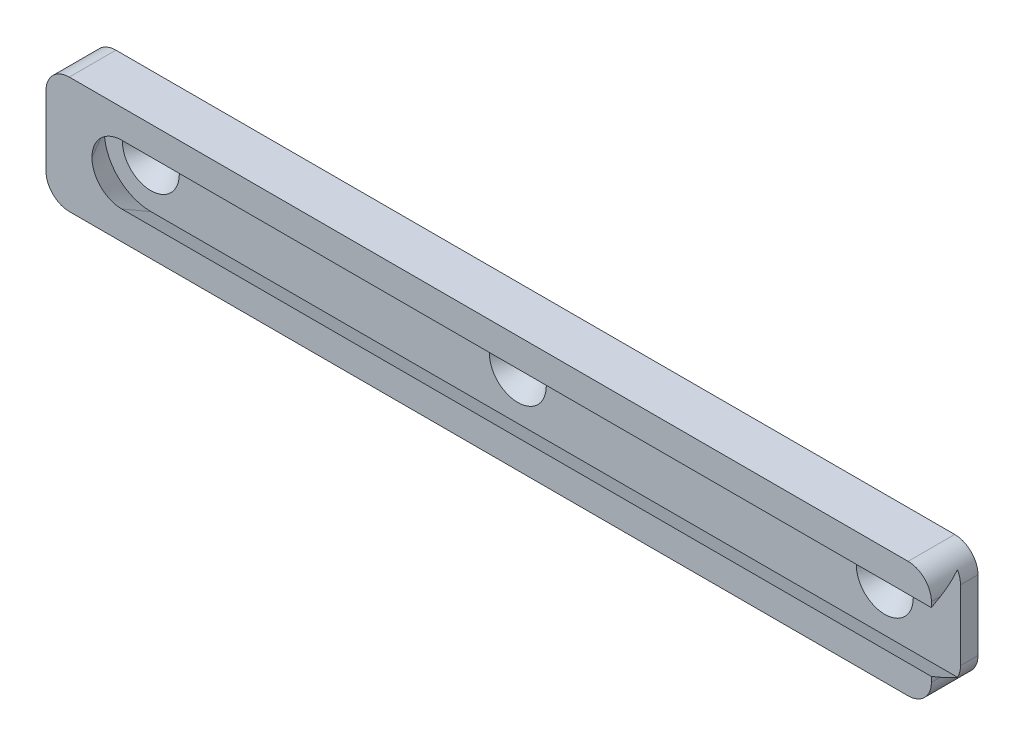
ISO-10303-21;
HEADER;
FILE_DESCRIPTION(('STEP AP214'),'2;1');
FILE_NAME('part.step','',(''),(''),'','','');
FILE_SCHEMA(('AUTOMOTIVE_DESIGN { 1 0 10303 214 1 1 1 1 }'));
ENDSEC;
DATA;
#1=APPLICATION_CONTEXT('core data for automotive mechanical design processes');
#2=APPLICATION_PROTOCOL_DEFINITION('international standard','automotive_design',2000,#1);
#3=PRODUCT_CONTEXT('',#1,'mechanical');
#4=PRODUCT('Part','Part','',(#3));
#5=PRODUCT_RELATED_PRODUCT_CATEGORY('part','',(#4));
#6=PRODUCT_DEFINITION_FORMATION('','',#4);
#7=PRODUCT_DEFINITION_CONTEXT('part definition',#1,'design');
#8=PRODUCT_DEFINITION('design','',#6,#7);
#9=PRODUCT_DEFINITION_SHAPE('','',#8);
#10=(LENGTH_UNIT() NAMED_UNIT(*) SI_UNIT(.MILLI.,.METRE.));
#11=(NAMED_UNIT(*) PLANE_ANGLE_UNIT() SI_UNIT($,.RADIAN.));
#12=(NAMED_UNIT(*) SI_UNIT($,.STERADIAN.) SOLID_ANGLE_UNIT());
#13=UNCERTAINTY_MEASURE_WITH_UNIT(LENGTH_MEASURE(1.E-05),#10,'distance_accuracy_value','');
#14=(GEOMETRIC_REPRESENTATION_CONTEXT(3) GLOBAL_UNCERTAINTY_ASSIGNED_CONTEXT((#13)) GLOBAL_UNIT_ASSIGNED_CONTEXT((#10,
#11,#12)) REPRESENTATION_CONTEXT('',''));
#15=CARTESIAN_POINT('',(0.,0.,0.));
#16=DIRECTION('',(0.,0.,1.));
#17=DIRECTION('',(1.,0.,0.));
#18=AXIS2_PLACEMENT_3D('',#15,#16,#17);
#19=CARTESIAN_POINT('',(0.,9.99999999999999,5.));
#20=DIRECTION('',(-1.,0.,0.));
#21=DIRECTION('',(0.,-1.,0.));
#22=AXIS2_PLACEMENT_3D('',#19,#20,#21);
#23=PLANE('',#22);
#24=DIRECTION('',(0.,1.,0.));
#25=VECTOR('',#24,1.);
#26=CARTESIAN_POINT('',(0.,9.99999999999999,5.));
#27=LINE('',#26,#25);
#28=CARTESIAN_POINT('',(0.,-5.99999999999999,5.));
#29=VERTEX_POINT('',#28);
#30=CARTESIAN_POINT('',(0.,-5.11324865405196,5.));
#31=VERTEX_POINT('',#30);
#32=EDGE_CURVE('E200',#29,#31,#27,.T.);
#33=ORIENTED_EDGE('',*,*,#32,.F.);
#34=DIRECTION('',(0.,0.,-1.));
#35=VECTOR('',#34,1.);
#36=CARTESIAN_POINT('',(0.,-5.99999999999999,5.));
#37=LINE('',#36,#35);
#38=CARTESIAN_POINT('',(0.,-5.99999999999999,3.4641016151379));
#39=VERTEX_POINT('',#38);
#40=EDGE_CURVE('E364',#29,#39,#37,.T.);
#41=ORIENTED_EDGE('',*,*,#40,.T.);
#42=DIRECTION('',(0.,-0.499999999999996,-0.866025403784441));
#43=VECTOR('',#42,1.);
#44=CARTESIAN_POINT('',(0.,-3.,8.66025403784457));
#45=LINE('',#44,#43);
#46=EDGE_CURVE('E180',#39,#31,#45,.F.);
#47=ORIENTED_EDGE('',*,*,#46,.T.);
#48=EDGE_LOOP('',(#33,#41,#47));
#49=FACE_BOUND('',#48,.T.);
#50=ADVANCED_FACE('F34',(#49),#23,.F.);
#51=DIRECTION('',(0.,1.,0.));
#52=VECTOR('',#51,1.);
#53=CARTESIAN_POINT('',(0.,-9.99999999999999,0.));
#54=LINE('',#53,#52);
#55=CARTESIAN_POINT('',(0.,-5.99999999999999,0.));
#56=VERTEX_POINT('',#55);
#57=CARTESIAN_POINT('',(0.,5.99999999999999,0.));
#58=VERTEX_POINT('',#57);
#59=EDGE_CURVE('E183',#56,#58,#54,.T.);
#60=ORIENTED_EDGE('',*,*,#59,.F.);
#61=DIRECTION('',(0.,0.,-1.));
#62=VECTOR('',#61,1.);
#63=CARTESIAN_POINT('',(0.,-5.99999999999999,5.));
#64=LINE('',#63,#62);
#65=CARTESIAN_POINT('',(0.,-5.99999999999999,-3.));
#66=VERTEX_POINT('',#65);
#67=EDGE_CURVE('E367',#56,#66,#64,.T.);
#68=ORIENTED_EDGE('',*,*,#67,.T.);
#69=DIRECTION('',(0.,1.,0.));
#70=VECTOR('',#69,1.);
#71=CARTESIAN_POINT('',(0.,-9.99999999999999,-3.));
#72=LINE('',#71,#70);
#73=CARTESIAN_POINT('',(0.,5.99999999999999,-3.));
#74=VERTEX_POINT('',#73);
#75=EDGE_CURVE('E187',#66,#74,#72,.T.);
#76=ORIENTED_EDGE('',*,*,#75,.T.);
#77=DIRECTION('',(0.,0.,-1.));
#78=VECTOR('',#77,1.);
#79=CARTESIAN_POINT('',(0.,5.99999999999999,5.));
#80=LINE('',#79,#78);
#81=EDGE_CURVE('E330',#74,#58,#80,.F.);
#82=ORIENTED_EDGE('',*,*,#81,.T.);
#83=EDGE_LOOP('',(#60,#68,#76,#82));
#84=FACE_BOUND('',#83,.T.);
#85=ADVANCED_FACE('F307',(#84),#23,.F.);
#86=CARTESIAN_POINT('',(-152.,9.99999999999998,5.));
#87=DIRECTION('',(1.,0.,0.));
#88=DIRECTION('',(0.,0.,-1.));
#89=AXIS2_PLACEMENT_3D('',#86,#87,#88);
#90=PLANE('',#89);
#91=DIRECTION('',(0.,-1.,0.));
#92=VECTOR('',#91,1.);
#93=CARTESIAN_POINT('',(-152.,-10.,-3.));
#94=LINE('',#93,#92);
#95=CARTESIAN_POINT('',(-152.,5.99999999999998,-3.));
#96=VERTEX_POINT('',#95);
#97=CARTESIAN_POINT('',(-152.,-6.00000000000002,-3.));
#98=VERTEX_POINT('',#97);
#99=EDGE_CURVE('E237',#96,#98,#94,.T.);
#100=ORIENTED_EDGE('',*,*,#99,.T.);
#101=DIRECTION('',(0.,0.,-1.));
#102=VECTOR('',#101,1.);
#103=CARTESIAN_POINT('',(-152.,-6.00000000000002,5.));
#104=LINE('',#103,#102);
#105=CARTESIAN_POINT('',(-152.,-6.00000000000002,5.));
#106=VERTEX_POINT('',#105);
#107=EDGE_CURVE('E11',#98,#106,#104,.F.);
#108=ORIENTED_EDGE('',*,*,#107,.T.);
#109=DIRECTION('',(0.,-1.,0.));
#110=VECTOR('',#109,1.);
#111=CARTESIAN_POINT('',(-152.,9.99999999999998,5.));
#112=LINE('',#111,#110);
#113=CARTESIAN_POINT('',(-152.,5.99999999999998,5.));
#114=VERTEX_POINT('',#113);
#115=EDGE_CURVE('E195',#114,#106,#112,.T.);
#116=ORIENTED_EDGE('',*,*,#115,.F.);
#117=DIRECTION('',(0.,0.,-1.));
#118=VECTOR('',#117,1.);
#119=CARTESIAN_POINT('',(-152.,5.99999999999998,5.));
#120=LINE('',#119,#118);
#121=EDGE_CURVE('E42',#114,#96,#120,.T.);
#122=ORIENTED_EDGE('',*,*,#121,.T.);
#123=EDGE_LOOP('',(#100,#108,#116,#122));
#124=FACE_BOUND('',#123,.T.);
#125=ADVANCED_FACE('F236',(#124),#90,.F.);
#126=CARTESIAN_POINT('',(-152.,-10.,5.));
#127=DIRECTION('',(0.,1.,0.));
#128=DIRECTION('',(-1.,0.,0.));
#129=AXIS2_PLACEMENT_3D('',#126,#127,#128);
#130=PLANE('',#129);
#131=DIRECTION('',(1.,0.,0.));
#132=VECTOR('',#131,1.);
#133=CARTESIAN_POINT('',(0.,-9.99999999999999,-3.));
#134=LINE('',#133,#132);
#135=CARTESIAN_POINT('',(-148.,-10.,-3.));
#136=VERTEX_POINT('',#135);
#137=CARTESIAN_POINT('',(-4.,-9.99999999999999,-3.));
#138=VERTEX_POINT('',#137);
#139=EDGE_CURVE('E193',#136,#138,#134,.T.);
#140=ORIENTED_EDGE('',*,*,#139,.T.);
#141=DIRECTION('',(0.,0.,-1.));
#142=VECTOR('',#141,1.);
#143=CARTESIAN_POINT('',(-4.,-9.99999999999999,5.));
#144=LINE('',#143,#142);
#145=CARTESIAN_POINT('',(-4.,-9.99999999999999,5.));
#146=VERTEX_POINT('',#145);
#147=EDGE_CURVE('E354',#138,#146,#144,.F.);
#148=ORIENTED_EDGE('',*,*,#147,.T.);
#149=DIRECTION('',(1.,0.,0.));
#150=VECTOR('',#149,1.);
#151=CARTESIAN_POINT('',(-152.,-10.,5.));
#152=LINE('',#151,#150);
#153=CARTESIAN_POINT('',(-148.,-10.,5.));
#154=VERTEX_POINT('',#153);
#155=EDGE_CURVE('E197',#154,#146,#152,.T.);
#156=ORIENTED_EDGE('',*,*,#155,.F.);
#157=DIRECTION('',(0.,0.,-1.));
#158=VECTOR('',#157,1.);
#159=CARTESIAN_POINT('',(-148.,-10.,5.));
#160=LINE('',#159,#158);
#161=EDGE_CURVE('E351',#154,#136,#160,.T.);
#162=ORIENTED_EDGE('',*,*,#161,.T.);
#163=EDGE_LOOP('',(#140,#148,#156,#162));
#164=FACE_BOUND('',#163,.T.);
#165=ADVANCED_FACE('F319',(#164),#130,.F.);
#166=DIRECTION('',(0.,-0.499999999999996,0.866025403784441));
#167=VECTOR('',#166,1.);
#168=CARTESIAN_POINT('',(0.,3.,8.66025403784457));
#169=LINE('',#168,#167);
#170=CARTESIAN_POINT('',(0.,5.11324865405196,5.));
#171=VERTEX_POINT('',#170);
#172=CARTESIAN_POINT('',(0.,5.99999999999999,3.4641016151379));
#173=VERTEX_POINT('',#172);
#174=EDGE_CURVE('E326',#171,#173,#169,.F.);
#175=ORIENTED_EDGE('',*,*,#174,.T.);
#176=DIRECTION('',(0.,0.,-1.));
#177=VECTOR('',#176,1.);
#178=CARTESIAN_POINT('',(0.,5.99999999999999,5.));
#179=LINE('',#178,#177);
#180=CARTESIAN_POINT('',(0.,5.99999999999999,5.));
#181=VERTEX_POINT('',#180);
#182=EDGE_CURVE('E219',#173,#181,#179,.F.);
#183=ORIENTED_EDGE('',*,*,#182,.T.);
#184=EDGE_CURVE('E199',#171,#181,#27,.T.);
#185=ORIENTED_EDGE('',*,*,#184,.F.);
#186=EDGE_LOOP('',(#175,#183,#185));
#187=FACE_BOUND('',#186,.T.);
#188=ADVANCED_FACE('F310',(#187),#23,.F.);
#189=CARTESIAN_POINT('',(-152.,9.99999999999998,5.));
#190=DIRECTION('',(0.,-1.,0.));
#191=DIRECTION('',(1.,0.,0.));
#192=AXIS2_PLACEMENT_3D('',#189,#190,#191);
#193=PLANE('',#192);
#194=DIRECTION('',(-1.,0.,0.));
#195=VECTOR('',#194,1.);
#196=CARTESIAN_POINT('',(-152.,9.99999999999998,5.));
#197=LINE('',#196,#195);
#198=CARTESIAN_POINT('',(-4.,9.99999999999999,5.));
#199=VERTEX_POINT('',#198);
#200=CARTESIAN_POINT('',(-148.,9.99999999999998,5.));
#201=VERTEX_POINT('',#200);
#202=EDGE_CURVE('E168',#199,#201,#197,.T.);
#203=ORIENTED_EDGE('',*,*,#202,.F.);
#204=DIRECTION('',(0.,0.,-1.));
#205=VECTOR('',#204,1.);
#206=CARTESIAN_POINT('',(-4.,9.99999999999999,5.));
#207=LINE('',#206,#205);
#208=CARTESIAN_POINT('',(-4.,9.99999999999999,-3.));
#209=VERTEX_POINT('',#208);
#210=EDGE_CURVE('E221',#199,#209,#207,.T.);
#211=ORIENTED_EDGE('',*,*,#210,.T.);
#212=DIRECTION('',(-1.,0.,0.));
#213=VECTOR('',#212,1.);
#214=CARTESIAN_POINT('',(0.,9.99999999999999,-3.));
#215=LINE('',#214,#213);
#216=CARTESIAN_POINT('',(-148.,9.99999999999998,-3.));
#217=VERTEX_POINT('',#216);
#218=EDGE_CURVE('E247',#209,#217,#215,.T.);
#219=ORIENTED_EDGE('',*,*,#218,.T.);
#220=DIRECTION('',(0.,0.,-1.));
#221=VECTOR('',#220,1.);
#222=CARTESIAN_POINT('',(-148.,9.99999999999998,5.));
#223=LINE('',#222,#221);
#224=EDGE_CURVE('E225',#217,#201,#223,.F.);
#225=ORIENTED_EDGE('',*,*,#224,.T.);
#226=EDGE_LOOP('',(#203,#211,#219,#225));
#227=FACE_BOUND('',#226,.T.);
#228=ADVANCED_FACE('F318',(#227),#193,.F.);
#229=CARTESIAN_POINT('',(0.,0.,5.));
#230=DIRECTION('',(0.,0.,1.));
#231=DIRECTION('',(1.,0.,0.));
#232=AXIS2_PLACEMENT_3D('',#229,#230,#231);
#233=PLANE('',#232);
#234=ORIENTED_EDGE('',*,*,#155,.T.);
#235=CARTESIAN_POINT('',(-4.,-5.99999999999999,5.));
#236=DIRECTION('',(0.,0.,1.));
#237=DIRECTION('',(1.,0.,0.));
#238=AXIS2_PLACEMENT_3D('',#235,#236,#237);
#239=CIRCLE('',#238,4.);
#240=EDGE_CURVE('E222',#146,#29,#239,.T.);
#241=ORIENTED_EDGE('',*,*,#240,.T.);
#242=ORIENTED_EDGE('',*,*,#32,.T.);
#243=DIRECTION('',(1.,0.,0.));
#244=VECTOR('',#243,1.);
#245=CARTESIAN_POINT('',(0.,-5.11324865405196,5.));
#246=LINE('',#245,#244);
#247=CARTESIAN_POINT('',(-139.,-5.11324865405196,5.));
#248=VERTEX_POINT('',#247);
#249=EDGE_CURVE('E328',#31,#248,#246,.F.);
#250=ORIENTED_EDGE('',*,*,#249,.T.);
#251=CARTESIAN_POINT('',(-139.,0.,5.));
#252=DIRECTION('',(0.,0.,1.));
#253=DIRECTION('',(1.,0.,0.));
#254=AXIS2_PLACEMENT_3D('',#251,#252,#253);
#255=CIRCLE('',#254,5.11324865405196);
#256=CARTESIAN_POINT('',(-144.113248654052,0.,5.));
#257=VERTEX_POINT('',#256);
#258=EDGE_CURVE('E331',#248,#257,#255,.F.);
#259=ORIENTED_EDGE('',*,*,#258,.T.);
#260=CARTESIAN_POINT('',(-139.,0.,5.));
#261=DIRECTION('',(0.,0.,1.));
#262=DIRECTION('',(1.,0.,0.));
#263=AXIS2_PLACEMENT_3D('',#260,#261,#262);
#264=CIRCLE('',#263,5.11324865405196);
#265=CARTESIAN_POINT('',(-139.,5.11324865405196,5.));
#266=VERTEX_POINT('',#265);
#267=EDGE_CURVE('E160',#257,#266,#264,.F.);
#268=ORIENTED_EDGE('',*,*,#267,.T.);
#269=DIRECTION('',(-1.,0.,0.));
#270=VECTOR('',#269,1.);
#271=CARTESIAN_POINT('',(0.,5.11324865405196,5.));
#272=LINE('',#271,#270);
#273=EDGE_CURVE('E175',#266,#171,#272,.F.);
#274=ORIENTED_EDGE('',*,*,#273,.T.);
#275=ORIENTED_EDGE('',*,*,#184,.T.);
#276=CARTESIAN_POINT('',(-4.,5.99999999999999,5.));
#277=DIRECTION('',(0.,0.,1.));
#278=DIRECTION('',(1.,0.,0.));
#279=AXIS2_PLACEMENT_3D('',#276,#277,#278);
#280=CIRCLE('',#279,4.);
#281=EDGE_CURVE('E207',#181,#199,#280,.T.);
#282=ORIENTED_EDGE('',*,*,#281,.T.);
#283=ORIENTED_EDGE('',*,*,#202,.T.);
#284=CARTESIAN_POINT('',(-148.,5.99999999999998,5.));
#285=DIRECTION('',(0.,0.,1.));
#286=DIRECTION('',(1.,0.,0.));
#287=AXIS2_PLACEMENT_3D('',#284,#285,#286);
#288=CIRCLE('',#287,4.);
#289=EDGE_CURVE('E54',#201,#114,#288,.T.);
#290=ORIENTED_EDGE('',*,*,#289,.T.);
#291=ORIENTED_EDGE('',*,*,#115,.T.);
#292=CARTESIAN_POINT('',(-148.,-6.00000000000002,5.));
#293=DIRECTION('',(0.,0.,1.));
#294=DIRECTION('',(1.,0.,0.));
#295=AXIS2_PLACEMENT_3D('',#292,#293,#294);
#296=CIRCLE('',#295,4.);
#297=EDGE_CURVE('E223',#106,#154,#296,.T.);
#298=ORIENTED_EDGE('',*,*,#297,.T.);
#299=EDGE_LOOP('',(#234,#241,#242,#250,#259,#268,#274,#275,#282,#283,#290,#291,#298));
#300=FACE_BOUND('',#299,.T.);
#301=ADVANCED_FACE('F206',(#300),#233,.T.);
#302=CARTESIAN_POINT('',(0.,3.,8.66025403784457));
#303=DIRECTION('',(0.,0.866025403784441,0.499999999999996));
#304=DIRECTION('',(1.,0.,0.));
#305=AXIS2_PLACEMENT_3D('',#302,#303,#304);
#306=PLANE('',#305);
#307=DIRECTION('',(-1.,0.,0.));
#308=VECTOR('',#307,1.);
#309=CARTESIAN_POINT('',(0.,8.00000000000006,0.));
#310=LINE('',#309,#308);
#311=CARTESIAN_POINT('',(-0.535898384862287,8.00000000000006,0.));
#312=VERTEX_POINT('',#311);
#313=CARTESIAN_POINT('',(-139.,8.00000000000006,0.));
#314=VERTEX_POINT('',#313);
#315=EDGE_CURVE('E165',#312,#314,#310,.T.);
#316=ORIENTED_EDGE('',*,*,#315,.F.);
#317=CARTESIAN_POINT('',(-4.,5.99999999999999,3.46410161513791));
#318=DIRECTION('',(0.,0.866025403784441,0.499999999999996));
#319=DIRECTION('',(0.,0.499999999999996,-0.866025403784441));
#320=AXIS2_PLACEMENT_3D('',#317,#318,#319);
#321=ELLIPSE('',#320,8.00000000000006,4.);
#322=EDGE_CURVE('E232',#312,#173,#321,.F.);
#323=ORIENTED_EDGE('',*,*,#322,.T.);
#324=ORIENTED_EDGE('',*,*,#174,.F.);
#325=ORIENTED_EDGE('',*,*,#273,.F.);
#326=DIRECTION('',(0.,-0.499999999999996,0.866025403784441));
#327=VECTOR('',#326,1.);
#328=CARTESIAN_POINT('',(-139.,8.00000000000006,0.));
#329=LINE('',#328,#327);
#330=EDGE_CURVE('E161',#314,#266,#329,.T.);
#331=ORIENTED_EDGE('',*,*,#330,.F.);
#332=EDGE_LOOP('',(#316,#323,#324,#325,#331));
#333=FACE_BOUND('',#332,.T.);
#334=ADVANCED_FACE('F373',(#333),#306,.F.);
#335=CARTESIAN_POINT('',(-139.,0.,0.));
#336=DIRECTION('',(0.,0.,-1.));
#337=DIRECTION('',(-1.,0.,0.));
#338=AXIS2_PLACEMENT_3D('',#335,#336,#337);
#339=CONICAL_SURFACE('',#338,8.00000000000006,0.523598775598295);
#340=ORIENTED_EDGE('',*,*,#330,.T.);
#341=ORIENTED_EDGE('',*,*,#267,.F.);
#342=DIRECTION('',(0.499999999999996,0.,0.866025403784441));
#343=VECTOR('',#342,1.);
#344=CARTESIAN_POINT('',(-147.,0.,0.));
#345=LINE('',#344,#343);
#346=CARTESIAN_POINT('',(-147.,0.,0.));
#347=VERTEX_POINT('',#346);
#348=EDGE_CURVE('E146',#347,#257,#345,.T.);
#349=ORIENTED_EDGE('',*,*,#348,.F.);
#350=CARTESIAN_POINT('',(-139.,0.,0.));
#351=DIRECTION('',(0.,0.,1.));
#352=DIRECTION('',(1.,0.,0.));
#353=AXIS2_PLACEMENT_3D('',#350,#351,#352);
#354=CIRCLE('',#353,8.00000000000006);
#355=EDGE_CURVE('E153',#314,#347,#354,.T.);
#356=ORIENTED_EDGE('',*,*,#355,.F.);
#357=EDGE_LOOP('',(#340,#341,#349,#356));
#358=FACE_BOUND('',#357,.T.);
#359=ADVANCED_FACE('F159',(#358),#339,.F.);
#360=CARTESIAN_POINT('',(-139.,0.,0.));
#361=DIRECTION('',(0.,0.,-1.));
#362=DIRECTION('',(-1.,0.,0.));
#363=AXIS2_PLACEMENT_3D('',#360,#361,#362);
#364=CONICAL_SURFACE('',#363,8.00000000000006,0.523598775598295);
#365=ORIENTED_EDGE('',*,*,#348,.T.);
#366=ORIENTED_EDGE('',*,*,#258,.F.);
#367=DIRECTION('',(0.,0.499999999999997,0.866025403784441));
#368=VECTOR('',#367,1.);
#369=CARTESIAN_POINT('',(-139.,-8.00000000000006,0.));
#370=LINE('',#369,#368);
#371=CARTESIAN_POINT('',(-139.,-8.00000000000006,0.));
#372=VERTEX_POINT('',#371);
#373=EDGE_CURVE('E148',#372,#248,#370,.T.);
#374=ORIENTED_EDGE('',*,*,#373,.F.);
#375=CARTESIAN_POINT('',(-139.,0.,0.));
#376=DIRECTION('',(0.,0.,1.));
#377=DIRECTION('',(1.,0.,0.));
#378=AXIS2_PLACEMENT_3D('',#375,#376,#377);
#379=CIRCLE('',#378,8.00000000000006);
#380=EDGE_CURVE('E142',#347,#372,#379,.T.);
#381=ORIENTED_EDGE('',*,*,#380,.F.);
#382=EDGE_LOOP('',(#365,#366,#374,#381));
#383=FACE_BOUND('',#382,.T.);
#384=ADVANCED_FACE('F144',(#383),#364,.F.);
#385=CARTESIAN_POINT('',(0.,-3.,8.66025403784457));
#386=DIRECTION('',(0.,-0.866025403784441,0.499999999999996));
#387=DIRECTION('',(-1.,0.,0.));
#388=AXIS2_PLACEMENT_3D('',#385,#386,#387);
#389=PLANE('',#388);
#390=ORIENTED_EDGE('',*,*,#46,.F.);
#391=CARTESIAN_POINT('',(-4.,-5.99999999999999,3.46410161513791));
#392=DIRECTION('',(0.,-0.866025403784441,0.499999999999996));
#393=DIRECTION('',(0.,-0.499999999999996,-0.866025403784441));
#394=AXIS2_PLACEMENT_3D('',#391,#392,#393);
#395=ELLIPSE('',#394,8.00000000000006,4.);
#396=CARTESIAN_POINT('',(-0.535898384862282,-8.00000000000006,0.));
#397=VERTEX_POINT('',#396);
#398=EDGE_CURVE('E339',#39,#397,#395,.F.);
#399=ORIENTED_EDGE('',*,*,#398,.T.);
#400=DIRECTION('',(1.,0.,0.));
#401=VECTOR('',#400,1.);
#402=CARTESIAN_POINT('',(0.,-8.00000000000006,0.));
#403=LINE('',#402,#401);
#404=EDGE_CURVE('E152',#372,#397,#403,.T.);
#405=ORIENTED_EDGE('',*,*,#404,.F.);
#406=ORIENTED_EDGE('',*,*,#373,.T.);
#407=ORIENTED_EDGE('',*,*,#249,.F.);
#408=EDGE_LOOP('',(#390,#399,#405,#406,#407));
#409=FACE_BOUND('',#408,.T.);
#410=ADVANCED_FACE('F376',(#409),#389,.F.);
#411=CARTESIAN_POINT('',(0.,0.,-3.));
#412=DIRECTION('',(0.,0.,1.));
#413=DIRECTION('',(1.,0.,0.));
#414=AXIS2_PLACEMENT_3D('',#411,#412,#413);
#415=PLANE('',#414);
#416=CARTESIAN_POINT('',(-139.,0.,-3.));
#417=DIRECTION('',(0.,0.,1.));
#418=DIRECTION('',(1.,0.,0.));
#419=AXIS2_PLACEMENT_3D('',#416,#417,#418);
#420=CIRCLE('',#419,2.55269999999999);
#421=CARTESIAN_POINT('',(-136.4473,0.,-3.));
#422=VERTEX_POINT('',#421);
#423=EDGE_CURVE('E270',#422,#422,#420,.T.);
#424=ORIENTED_EDGE('',*,*,#423,.T.);
#425=EDGE_LOOP('',(#424));
#426=FACE_BOUND('',#425,.T.);
#427=CARTESIAN_POINT('',(-75.9999999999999,0.,-3.));
#428=DIRECTION('',(0.,0.,1.));
#429=DIRECTION('',(1.,0.,0.));
#430=AXIS2_PLACEMENT_3D('',#427,#428,#429);
#431=CIRCLE('',#430,2.55270000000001);
#432=CARTESIAN_POINT('',(-73.4472999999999,0.,-3.));
#433=VERTEX_POINT('',#432);
#434=EDGE_CURVE('E261',#433,#433,#431,.T.);
#435=ORIENTED_EDGE('',*,*,#434,.T.);
#436=EDGE_LOOP('',(#435));
#437=FACE_BOUND('',#436,.T.);
#438=CARTESIAN_POINT('',(-12.9999999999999,0.,-3.));
#439=DIRECTION('',(0.,0.,1.));
#440=DIRECTION('',(1.,0.,0.));
#441=AXIS2_PLACEMENT_3D('',#438,#439,#440);
#442=CIRCLE('',#441,2.5527);
#443=CARTESIAN_POINT('',(-10.4472999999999,0.,-3.));
#444=VERTEX_POINT('',#443);
#445=EDGE_CURVE('E188',#444,#444,#442,.T.);
#446=ORIENTED_EDGE('',*,*,#445,.T.);
#447=EDGE_LOOP('',(#446));
#448=FACE_BOUND('',#447,.T.);
#449=ORIENTED_EDGE('',*,*,#75,.F.);
#450=CARTESIAN_POINT('',(-4.,-5.99999999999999,-3.));
#451=DIRECTION('',(0.,0.,1.));
#452=DIRECTION('',(1.,0.,0.));
#453=AXIS2_PLACEMENT_3D('',#450,#451,#452);
#454=CIRCLE('',#453,4.);
#455=EDGE_CURVE('E349',#66,#138,#454,.F.);
#456=ORIENTED_EDGE('',*,*,#455,.T.);
#457=ORIENTED_EDGE('',*,*,#139,.F.);
#458=CARTESIAN_POINT('',(-148.,-6.00000000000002,-3.));
#459=DIRECTION('',(0.,0.,1.));
#460=DIRECTION('',(1.,0.,0.));
#461=AXIS2_PLACEMENT_3D('',#458,#459,#460);
#462=CIRCLE('',#461,4.);
#463=EDGE_CURVE('E246',#136,#98,#462,.F.);
#464=ORIENTED_EDGE('',*,*,#463,.T.);
#465=ORIENTED_EDGE('',*,*,#99,.F.);
#466=CARTESIAN_POINT('',(-148.,5.99999999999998,-3.));
#467=DIRECTION('',(0.,0.,1.));
#468=DIRECTION('',(1.,0.,0.));
#469=AXIS2_PLACEMENT_3D('',#466,#467,#468);
#470=CIRCLE('',#469,4.);
#471=EDGE_CURVE('E243',#96,#217,#470,.F.);
#472=ORIENTED_EDGE('',*,*,#471,.T.);
#473=ORIENTED_EDGE('',*,*,#218,.F.);
#474=CARTESIAN_POINT('',(-4.,5.99999999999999,-3.));
#475=DIRECTION('',(0.,0.,1.));
#476=DIRECTION('',(1.,0.,0.));
#477=AXIS2_PLACEMENT_3D('',#474,#475,#476);
#478=CIRCLE('',#477,4.);
#479=EDGE_CURVE('E347',#209,#74,#478,.F.);
#480=ORIENTED_EDGE('',*,*,#479,.T.);
#481=EDGE_LOOP('',(#449,#456,#457,#464,#465,#472,#473,#480));
#482=FACE_BOUND('',#481,.T.);
#483=ADVANCED_FACE('F241',(#426,#437,#448,#482),#415,.F.);
#484=CARTESIAN_POINT('',(0.,0.,0.));
#485=DIRECTION('',(0.,0.,1.));
#486=DIRECTION('',(1.,0.,0.));
#487=AXIS2_PLACEMENT_3D('',#484,#485,#486);
#488=PLANE('',#487);
#489=CARTESIAN_POINT('',(-139.,0.,0.));
#490=DIRECTION('',(0.,0.,1.));
#491=DIRECTION('',(1.,0.,0.));
#492=AXIS2_PLACEMENT_3D('',#489,#490,#491);
#493=CIRCLE('',#492,4.88949999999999);
#494=CARTESIAN_POINT('',(-134.1105,0.,0.));
#495=VERTEX_POINT('',#494);
#496=EDGE_CURVE('E276',#495,#495,#493,.T.);
#497=ORIENTED_EDGE('',*,*,#496,.F.);
#498=EDGE_LOOP('',(#497));
#499=FACE_BOUND('',#498,.T.);
#500=CARTESIAN_POINT('',(-75.9999999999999,0.,0.));
#501=DIRECTION('',(0.,0.,1.));
#502=DIRECTION('',(1.,0.,0.));
#503=AXIS2_PLACEMENT_3D('',#500,#501,#502);
#504=CIRCLE('',#503,4.88950000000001);
#505=CARTESIAN_POINT('',(-71.1104999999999,0.,0.));
#506=VERTEX_POINT('',#505);
#507=EDGE_CURVE('E267',#506,#506,#504,.T.);
#508=ORIENTED_EDGE('',*,*,#507,.F.);
#509=EDGE_LOOP('',(#508));
#510=FACE_BOUND('',#509,.T.);
#511=CARTESIAN_POINT('',(-12.9999999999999,0.,0.));
#512=DIRECTION('',(0.,0.,1.));
#513=DIRECTION('',(1.,0.,0.));
#514=AXIS2_PLACEMENT_3D('',#511,#512,#513);
#515=CIRCLE('',#514,4.8895);
#516=CARTESIAN_POINT('',(-8.11049999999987,0.,0.));
#517=VERTEX_POINT('',#516);
#518=EDGE_CURVE('E258',#517,#517,#515,.T.);
#519=ORIENTED_EDGE('',*,*,#518,.F.);
#520=EDGE_LOOP('',(#519));
#521=FACE_BOUND('',#520,.T.);
#522=ORIENTED_EDGE('',*,*,#404,.T.);
#523=CARTESIAN_POINT('',(-4.,-5.99999999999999,0.));
#524=DIRECTION('',(0.,0.,1.));
#525=DIRECTION('',(1.,0.,0.));
#526=AXIS2_PLACEMENT_3D('',#523,#524,#525);
#527=CIRCLE('',#526,4.);
#528=EDGE_CURVE('E343',#397,#56,#527,.T.);
#529=ORIENTED_EDGE('',*,*,#528,.T.);
#530=ORIENTED_EDGE('',*,*,#59,.T.);
#531=CARTESIAN_POINT('',(-4.,5.99999999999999,0.));
#532=DIRECTION('',(0.,0.,1.));
#533=DIRECTION('',(1.,0.,0.));
#534=AXIS2_PLACEMENT_3D('',#531,#532,#533);
#535=CIRCLE('',#534,4.);
#536=EDGE_CURVE('E341',#58,#312,#535,.T.);
#537=ORIENTED_EDGE('',*,*,#536,.T.);
#538=ORIENTED_EDGE('',*,*,#315,.T.);
#539=ORIENTED_EDGE('',*,*,#355,.T.);
#540=ORIENTED_EDGE('',*,*,#380,.T.);
#541=EDGE_LOOP('',(#522,#529,#530,#537,#538,#539,#540));
#542=FACE_BOUND('',#541,.T.);
#543=ADVANCED_FACE('F163',(#499,#510,#521,#542),#488,.T.);
#544=CARTESIAN_POINT('',(-4.,-5.99999999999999,5.));
#545=DIRECTION('',(0.,0.,-1.));
#546=DIRECTION('',(-1.,0.,0.));
#547=AXIS2_PLACEMENT_3D('',#544,#545,#546);
#548=CYLINDRICAL_SURFACE('',#547,4.);
#549=ORIENTED_EDGE('',*,*,#240,.F.);
#550=ORIENTED_EDGE('',*,*,#147,.F.);
#551=ORIENTED_EDGE('',*,*,#455,.F.);
#552=ORIENTED_EDGE('',*,*,#67,.F.);
#553=ORIENTED_EDGE('',*,*,#528,.F.);
#554=ORIENTED_EDGE('',*,*,#398,.F.);
#555=ORIENTED_EDGE('',*,*,#40,.F.);
#556=EDGE_LOOP('',(#549,#550,#551,#552,#553,#554,#555));
#557=FACE_BOUND('',#556,.T.);
#558=ADVANCED_FACE('F284',(#557),#548,.T.);
#559=CARTESIAN_POINT('',(-4.,5.99999999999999,5.));
#560=DIRECTION('',(0.,0.,-1.));
#561=DIRECTION('',(-1.,0.,0.));
#562=AXIS2_PLACEMENT_3D('',#559,#560,#561);
#563=CYLINDRICAL_SURFACE('',#562,4.);
#564=ORIENTED_EDGE('',*,*,#536,.F.);
#565=ORIENTED_EDGE('',*,*,#81,.F.);
#566=ORIENTED_EDGE('',*,*,#479,.F.);
#567=ORIENTED_EDGE('',*,*,#210,.F.);
#568=ORIENTED_EDGE('',*,*,#281,.F.);
#569=ORIENTED_EDGE('',*,*,#182,.F.);
#570=ORIENTED_EDGE('',*,*,#322,.F.);
#571=EDGE_LOOP('',(#564,#565,#566,#567,#568,#569,#570));
#572=FACE_BOUND('',#571,.T.);
#573=ADVANCED_FACE('F217',(#572),#563,.T.);
#574=CARTESIAN_POINT('',(-148.,-6.00000000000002,5.));
#575=DIRECTION('',(0.,0.,-1.));
#576=DIRECTION('',(-1.,0.,0.));
#577=AXIS2_PLACEMENT_3D('',#574,#575,#576);
#578=CYLINDRICAL_SURFACE('',#577,4.);
#579=ORIENTED_EDGE('',*,*,#297,.F.);
#580=ORIENTED_EDGE('',*,*,#107,.F.);
#581=ORIENTED_EDGE('',*,*,#463,.F.);
#582=ORIENTED_EDGE('',*,*,#161,.F.);
#583=EDGE_LOOP('',(#579,#580,#581,#582));
#584=FACE_BOUND('',#583,.T.);
#585=ADVANCED_FACE('F381',(#584),#578,.T.);
#586=CARTESIAN_POINT('',(-148.,5.99999999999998,5.));
#587=DIRECTION('',(0.,0.,-1.));
#588=DIRECTION('',(-1.,0.,0.));
#589=AXIS2_PLACEMENT_3D('',#586,#587,#588);
#590=CYLINDRICAL_SURFACE('',#589,4.);
#591=ORIENTED_EDGE('',*,*,#289,.F.);
#592=ORIENTED_EDGE('',*,*,#224,.F.);
#593=ORIENTED_EDGE('',*,*,#471,.F.);
#594=ORIENTED_EDGE('',*,*,#121,.F.);
#595=EDGE_LOOP('',(#591,#592,#593,#594));
#596=FACE_BOUND('',#595,.T.);
#597=ADVANCED_FACE('F36',(#596),#590,.T.);
#598=CARTESIAN_POINT('',(-12.9999999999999,0.,0.));
#599=DIRECTION('',(0.,0.,1.));
#600=DIRECTION('',(1.,0.,0.));
#601=AXIS2_PLACEMENT_3D('',#598,#599,#600);
#602=CYLINDRICAL_SURFACE('',#601,2.5527);
#603=ORIENTED_EDGE('',*,*,#445,.F.);
#604=EDGE_LOOP('',(#603));
#605=FACE_BOUND('',#604,.T.);
#606=CARTESIAN_POINT('',(-12.9999999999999,0.,-2.68818089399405));
#607=DIRECTION('',(0.,0.,1.));
#608=DIRECTION('',(1.,0.,0.));
#609=AXIS2_PLACEMENT_3D('',#606,#607,#608);
#610=CIRCLE('',#609,2.5527);
#611=CARTESIAN_POINT('',(-10.4472999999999,0.,-2.68818089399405));
#612=VERTEX_POINT('',#611);
#613=EDGE_CURVE('E255',#612,#612,#610,.T.);
#614=ORIENTED_EDGE('',*,*,#613,.T.);
#615=EDGE_LOOP('',(#614));
#616=FACE_BOUND('',#615,.T.);
#617=ADVANCED_FACE('F293',(#605,#616),#602,.F.);
#618=CARTESIAN_POINT('',(-12.9999999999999,0.,0.));
#619=DIRECTION('',(0.,0.,1.));
#620=DIRECTION('',(1.,0.,0.));
#621=AXIS2_PLACEMENT_3D('',#618,#619,#620);
#622=CONICAL_SURFACE('',#621,4.8895,0.715584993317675);
#623=ORIENTED_EDGE('',*,*,#613,.F.);
#624=EDGE_LOOP('',(#623));
#625=FACE_BOUND('',#624,.T.);
#626=ORIENTED_EDGE('',*,*,#518,.T.);
#627=EDGE_LOOP('',(#626));
#628=FACE_BOUND('',#627,.T.);
#629=ADVANCED_FACE('F290',(#625,#628),#622,.F.);
#630=CARTESIAN_POINT('',(-75.9999999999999,0.,0.));
#631=DIRECTION('',(0.,0.,1.));
#632=DIRECTION('',(1.,0.,0.));
#633=AXIS2_PLACEMENT_3D('',#630,#631,#632);
#634=CYLINDRICAL_SURFACE('',#633,2.55270000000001);
#635=ORIENTED_EDGE('',*,*,#434,.F.);
#636=EDGE_LOOP('',(#635));
#637=FACE_BOUND('',#636,.T.);
#638=CARTESIAN_POINT('',(-75.9999999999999,0.,-2.68818089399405));
#639=DIRECTION('',(0.,0.,1.));
#640=DIRECTION('',(1.,0.,0.));
#641=AXIS2_PLACEMENT_3D('',#638,#639,#640);
#642=CIRCLE('',#641,2.55270000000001);
#643=CARTESIAN_POINT('',(-73.4472999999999,0.,-2.68818089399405));
#644=VERTEX_POINT('',#643);
#645=EDGE_CURVE('E264',#644,#644,#642,.T.);
#646=ORIENTED_EDGE('',*,*,#645,.T.);
#647=EDGE_LOOP('',(#646));
#648=FACE_BOUND('',#647,.T.);
#649=ADVANCED_FACE('F292',(#637,#648),#634,.F.);
#650=CARTESIAN_POINT('',(-75.9999999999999,0.,0.));
#651=DIRECTION('',(0.,0.,1.));
#652=DIRECTION('',(1.,0.,0.));
#653=AXIS2_PLACEMENT_3D('',#650,#651,#652);
#654=CONICAL_SURFACE('',#653,4.88950000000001,0.715584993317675);
#655=ORIENTED_EDGE('',*,*,#645,.F.);
#656=EDGE_LOOP('',(#655));
#657=FACE_BOUND('',#656,.T.);
#658=ORIENTED_EDGE('',*,*,#507,.T.);
#659=EDGE_LOOP('',(#658));
#660=FACE_BOUND('',#659,.T.);
#661=ADVANCED_FACE('F300',(#657,#660),#654,.F.);
#662=CARTESIAN_POINT('',(-139.,0.,0.));
#663=DIRECTION('',(0.,0.,1.));
#664=DIRECTION('',(1.,0.,0.));
#665=AXIS2_PLACEMENT_3D('',#662,#663,#664);
#666=CYLINDRICAL_SURFACE('',#665,2.55269999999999);
#667=ORIENTED_EDGE('',*,*,#423,.F.);
#668=EDGE_LOOP('',(#667));
#669=FACE_BOUND('',#668,.T.);
#670=CARTESIAN_POINT('',(-139.,0.,-2.68818089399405));
#671=DIRECTION('',(0.,0.,1.));
#672=DIRECTION('',(1.,0.,0.));
#673=AXIS2_PLACEMENT_3D('',#670,#671,#672);
#674=CIRCLE('',#673,2.55269999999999);
#675=CARTESIAN_POINT('',(-136.4473,0.,-2.68818089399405));
#676=VERTEX_POINT('',#675);
#677=EDGE_CURVE('E273',#676,#676,#674,.T.);
#678=ORIENTED_EDGE('',*,*,#677,.T.);
#679=EDGE_LOOP('',(#678));
#680=FACE_BOUND('',#679,.T.);
#681=ADVANCED_FACE('F507',(#669,#680),#666,.F.);
#682=CARTESIAN_POINT('',(-139.,0.,0.));
#683=DIRECTION('',(0.,0.,1.));
#684=DIRECTION('',(1.,0.,0.));
#685=AXIS2_PLACEMENT_3D('',#682,#683,#684);
#686=CONICAL_SURFACE('',#685,4.88949999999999,0.715584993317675);
#687=ORIENTED_EDGE('',*,*,#677,.F.);
#688=EDGE_LOOP('',(#687));
#689=FACE_BOUND('',#688,.T.);
#690=ORIENTED_EDGE('',*,*,#496,.T.);
#691=EDGE_LOOP('',(#690));
#692=FACE_BOUND('',#691,.T.);
#693=ADVANCED_FACE('F280',(#689,#692),#686,.F.);
#694=CLOSED_SHELL('',(#50,#85,#125,#165,#188,#228,#301,#334,#359,#384,#410,#483,#543,#558,#573,
#585,#597,#617,#629,#649,#661,#681,#693));
#695=MANIFOLD_SOLID_BREP('B2',#694);
#696=ADVANCED_BREP_SHAPE_REPRESENTATION('',(#18,#695),#14);
#697=SHAPE_DEFINITION_REPRESENTATION(#9,#696);
ENDSEC;
END-ISO-10303-21;
